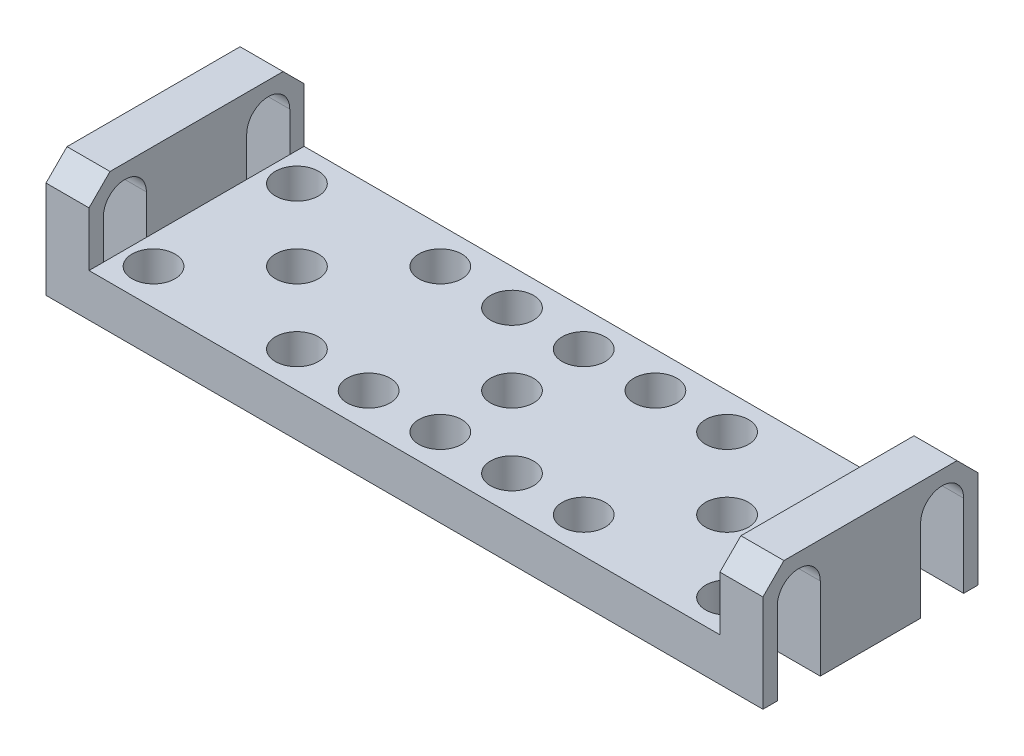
from build123d import *

# Parameters (mm, degrees)
ESQUISSE1_W             = 50
ESQUISSE1_H             = 15
ESQUISSE1_R             = 1.5
BOSS_EXTRU_1_DEPTH      = 3
BOSS_EXTRU_2_START      = 25
BOSS_EXTRU_2_DEPTH      = 3
ENL_V_MAT_EXTRU_1_DEPTH = 3
BOSS_EXTRU_3_START      = -25
BOSS_EXTRU_3_DEPTH      = 3
ENL_V_MAT_EXTRU_2_DEPTH = 1


with BuildPart() as part:
    # Esquisse1 → Boss.-Extru.1 (new body)
    with BuildSketch(Plane(origin=(0, 0, 0), x_dir=(1, 0, 0), z_dir=(0, 1, 0))):
        Rectangle(ESQUISSE1_W, ESQUISSE1_H)
        with Locations(Location((0, 0, 0), (0, 0, 270))):
            Circle(ESQUISSE1_R, mode=Mode.SUBTRACT)
        with Locations(Location((0, 5, 0), (0, 0, 270))):
            Circle(ESQUISSE1_R, mode=Mode.SUBTRACT)
        with Locations(Location((5, 5, 0), (0, 0, 270))):
            Circle(ESQUISSE1_R, mode=Mode.SUBTRACT)
        with Locations(Location((10, 5, 0), (0, 0, 270))):
            Circle(ESQUISSE1_R, mode=Mode.SUBTRACT)
        with Locations(Location((10, -5, 0), (0, 0, 90))):
            Circle(ESQUISSE1_R, mode=Mode.SUBTRACT)
        with Locations(Location((5, -5, 0), (0, 0, 90))):
            Circle(ESQUISSE1_R, mode=Mode.SUBTRACT)
        with Locations(Location((0, -5, 0), (0, 0, 90))):
            Circle(ESQUISSE1_R, mode=Mode.SUBTRACT)
        with Locations(Location((-10, -5, 0), (0, 0, 270))):
            Circle(ESQUISSE1_R, mode=Mode.SUBTRACT)
        with Locations(Location((-5, -5, 0), (0, 0, 270))):
            Circle(ESQUISSE1_R, mode=Mode.SUBTRACT)
        with Locations(Location((-10, 5, 0), (0, 0, 90))):
            Circle(ESQUISSE1_R, mode=Mode.SUBTRACT)
        with Locations(Location((-5, 5, 0), (0, 0, 90))):
            Circle(ESQUISSE1_R, mode=Mode.SUBTRACT)
        with Locations(Location((15, 0, 0), (0, 0, 270))):
            Circle(ESQUISSE1_R, mode=Mode.SUBTRACT)
        with Locations(Location((20, -5, 0), (0, 0, 270))):
            Circle(ESQUISSE1_R, mode=Mode.SUBTRACT)
        with Locations(Location((20, 5, 0), (0, 0, 90))):
            Circle(ESQUISSE1_R, mode=Mode.SUBTRACT)
        with Locations(Location((-20, -5, 0), (0, 0, 90))):
            Circle(ESQUISSE1_R, mode=Mode.SUBTRACT)
        with Locations(Location((-20, 5, 0), (0, 0, 270))):
            Circle(ESQUISSE1_R, mode=Mode.SUBTRACT)
        with Locations(Location((-15, 0, 0), (0, 0, 90))):
            Circle(ESQUISSE1_R, mode=Mode.SUBTRACT)
    extrude(amount=BOSS_EXTRU_1_DEPTH)

    # Esquisse2 → Boss.-Extru.2 (add)
    with BuildSketch(Plane(origin=(0, 0, 0), x_dir=(0, 0, -1), z_dir=(1, 0, 0)).offset(BOSS_EXTRU_2_START)):
        Polygon((6.035533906, 8.25), (7.5, 6.785533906), (7.5, 0), (-7.5, 0), (-7.5, 6.785533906), (-6.035533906, 8.25), align=None)
    extrude(amount=-BOSS_EXTRU_2_DEPTH)

    # Esquisse3 → Enl_v. mat.-Extru.1 (cut)
    with BuildSketch(Plane(origin=(25, 0, 0), x_dir=(0, 0, -1), z_dir=(1, 0, 0))):
        with BuildLine():
            Line((-3.5, 5.75), (-3.5, -1.310109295))
            ThreePointArc((-3.5, -1.310109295), (-5, -2.810109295), (-6.5, -1.310109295))
            Line((-6.5, -1.310109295), (-6.5, 5.75))
            ThreePointArc((-6.5, 5.75), (-5, 7.25), (-3.5, 5.75))
        make_face()
        with BuildLine():
            Line((3.5, 5.75), (3.5, -1.310109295))
            ThreePointArc((3.5, -1.310109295), (5, -2.810109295), (6.5, -1.310109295))
            Line((6.5, -1.310109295), (6.5, 5.75))
            ThreePointArc((6.5, 5.75), (5, 7.25), (3.5, 5.75))
        make_face()
    enl_v_mat_extru_1 = extrude(amount=-ENL_V_MAT_EXTRU_1_DEPTH, mode=Mode.SUBTRACT)

    # Esquisse2_2 → Boss.-Extru.3 (add)
    with BuildSketch(Plane(origin=(0, 0, 0), x_dir=(0, 0, -1), z_dir=(1, 0, 0)).offset(BOSS_EXTRU_3_START)):
        Polygon((6.035533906, 8.25), (7.5, 6.785533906), (7.5, 0), (-7.5, 0), (-7.5, 6.785533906), (-6.035533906, 8.25), align=None)
    extrude(amount=BOSS_EXTRU_3_DEPTH)

    # Sym_trie2: Enl_v. mat.-Extru.1 across plane
    add(enl_v_mat_extru_1.mirror(Plane(origin=(0, 0, 0), x_dir=(0, 0, 1), z_dir=(1, 0, 0))), mode=Mode.SUBTRACT)

    # Esquisse4 → Enl_v. mat.-Extru.2 (cut)
    with BuildSketch(Plane(origin=(0, 0, 0), x_dir=(1, 0, 0), z_dir=(0, 1, 0))):
        with BuildLine():
            Line((-11.83772234, 1.5), (-3.16227766, 1.5))
            ThreePointArc((-3.16227766, 1.5), (-3.5, 0), (-3.16227766, -1.5))
            Line((-3.16227766, -1.5), (-11.83772234, -1.5))
            ThreePointArc((-11.83772234, -1.5), (-11.5, 0), (-11.83772234, 1.5))
        make_face()
        with BuildLine():
            Line((-16.83772234, 3.5), (-13.16227766, 3.5))
            ThreePointArc((-13.16227766, 3.5), (-13.5, 5), (-13.16227766, 6.5))
            Line((-13.16227766, 6.5), (-16.83772234, 6.5))
            ThreePointArc((-16.83772234, 6.5), (-16.5, 5), (-16.83772234, 3.5))
        make_face()
        with BuildLine():
            Line((-16.83772234, -3.5), (-13.16227766, -3.5))
            ThreePointArc((-13.16227766, -3.5), (-13.5, -5), (-13.16227766, -6.5))
            Line((-13.16227766, -6.5), (-16.83772234, -6.5))
            ThreePointArc((-16.83772234, -6.5), (-16.5, -5), (-16.83772234, -3.5))
        make_face()
        with BuildLine():
            Line((13.16227766, -6.5), (16.83772234, -6.5))
            ThreePointArc((16.83772234, -6.5), (16.5, -5), (16.83772234, -3.5))
            Line((16.83772234, -3.5), (13.16227766, -3.5))
            ThreePointArc((13.16227766, -3.5), (13.5, -5), (13.16227766, -6.5))
        make_face()
        with BuildLine():
            Line((16.83772234, 3.5), (13.16227766, 3.5))
            ThreePointArc((13.16227766, 3.5), (13.5, 5), (13.16227766, 6.5))
            Line((13.16227766, 6.5), (16.83772234, 6.5))
            ThreePointArc((16.83772234, 6.5), (16.5, 5), (16.83772234, 3.5))
        make_face()
        with BuildLine():
            Line((11.83772234, -1.5), (3.16227766, -1.5))
            ThreePointArc((3.16227766, -1.5), (3.5, 0), (3.16227766, 1.5))
            Line((3.16227766, 1.5), (11.83772234, 1.5))
            ThreePointArc((11.83772234, 1.5), (11.5, 0), (11.83772234, -1.5))
        make_face()
        with BuildLine():
            Line((-24, 1.5), (-18.16227766, 1.5))
            ThreePointArc((-18.16227766, 1.5), (-18.5, 0), (-18.16227766, -1.5))
            Line((-18.16227766, -1.5), (-24, -1.5))
            Line((-24, -1.5), (-24, 1.5))
        make_face()
        with BuildLine():
            Line((24, 1.5), (18.16227766, 1.5))
            ThreePointArc((18.16227766, 1.5), (18.5, 0), (18.16227766, -1.5))
            Line((18.16227766, -1.5), (24, -1.5))
            Line((24, -1.5), (24, 1.5))
        make_face()
    extrude(amount=ENL_V_MAT_EXTRU_2_DEPTH, mode=Mode.SUBTRACT)


solid = part.part
